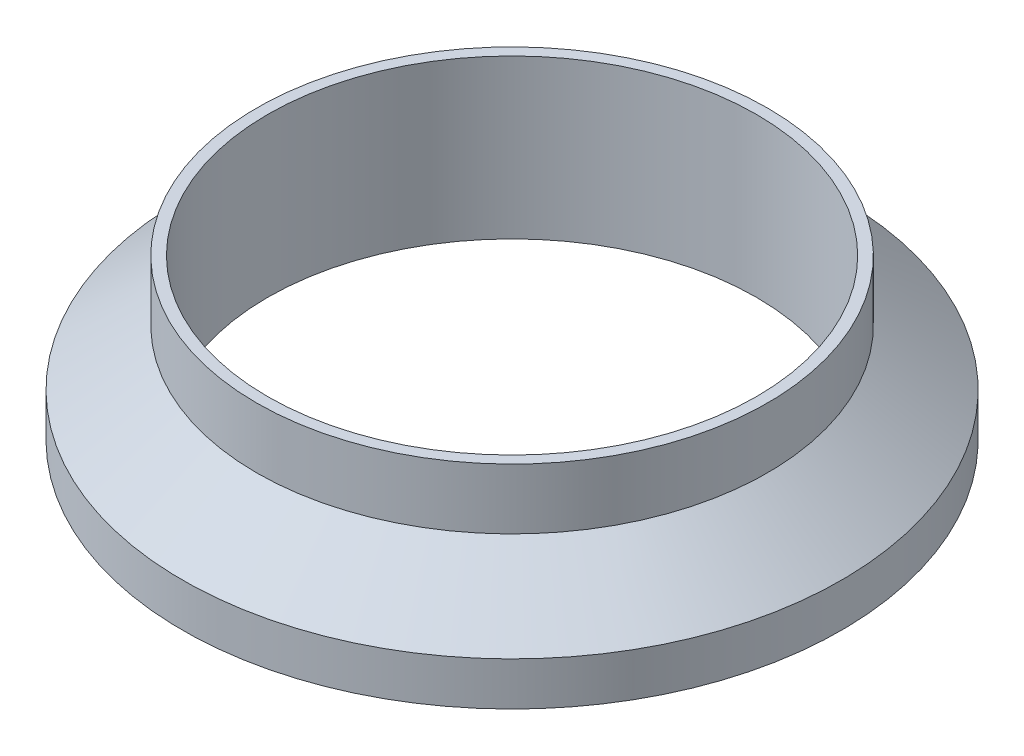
from build123d import *


with BuildPart() as part:
    # Sketch1 → Revolve1 (revolve)
    with BuildSketch(Plane.XY, mode=Mode.PRIVATE) as revolve1_sk:
        with BuildLine():
            Line((-36.449, 0.196645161), (-36.449, 23.8252))
            Line((-36.449, 23.8252), (-38.1, 23.8252))
            Line((-38.1, 23.8252), (-38.1, 14.8030187))
            Line((-38.1, 14.8030187), (-49.149, 6.477))
            Line((-49.149, 6.477), (-49.149, 0))
            Line((-49.149, 0), (-45.15600504, 0))
            ThreePointArc((-45.15600504, 0), (-42.899369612, 2.004489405), (-40.482330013, 0.196645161))
            Line((-40.482330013, 0.196645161), (-36.449, 0.196645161))
        make_face()
    revolve(revolve1_sk.sketch.rotate(Axis((0, 0, 0), (0, 1, 0)), 270), axis=Axis((0, 0, 0), (0, 1, 0)))


solid = part.part
